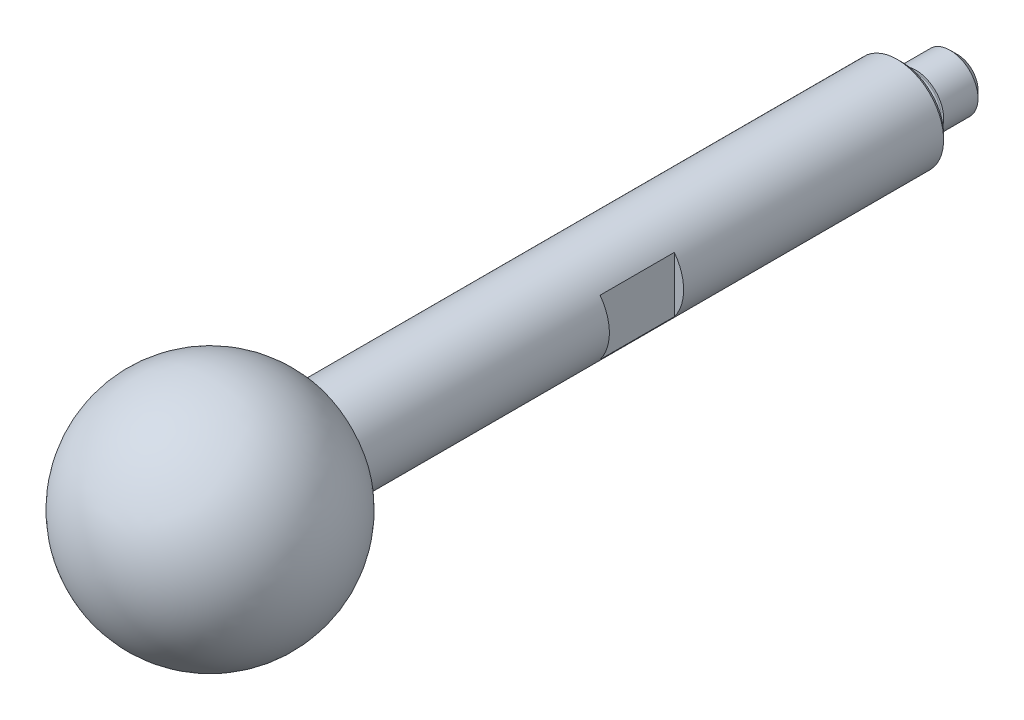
ISO-10303-21;
HEADER;
FILE_DESCRIPTION(('STEP AP214'),'2;1');
FILE_NAME('part.step','',(''),(''),'','','');
FILE_SCHEMA(('AUTOMOTIVE_DESIGN { 1 0 10303 214 1 1 1 1 }'));
ENDSEC;
DATA;
#1=APPLICATION_CONTEXT('core data for automotive mechanical design processes');
#2=APPLICATION_PROTOCOL_DEFINITION('international standard','automotive_design',2000,#1);
#3=PRODUCT_CONTEXT('',#1,'mechanical');
#4=PRODUCT('Part','Part','',(#3));
#5=PRODUCT_RELATED_PRODUCT_CATEGORY('part','',(#4));
#6=PRODUCT_DEFINITION_FORMATION('','',#4);
#7=PRODUCT_DEFINITION_CONTEXT('part definition',#1,'design');
#8=PRODUCT_DEFINITION('design','',#6,#7);
#9=PRODUCT_DEFINITION_SHAPE('','',#8);
#10=(LENGTH_UNIT() NAMED_UNIT(*) SI_UNIT(.MILLI.,.METRE.));
#11=(NAMED_UNIT(*) PLANE_ANGLE_UNIT() SI_UNIT($,.RADIAN.));
#12=(NAMED_UNIT(*) SI_UNIT($,.STERADIAN.) SOLID_ANGLE_UNIT());
#13=UNCERTAINTY_MEASURE_WITH_UNIT(LENGTH_MEASURE(1.E-05),#10,'distance_accuracy_value','');
#14=(GEOMETRIC_REPRESENTATION_CONTEXT(3) GLOBAL_UNCERTAINTY_ASSIGNED_CONTEXT((#13)) GLOBAL_UNIT_ASSIGNED_CONTEXT((#10,
#11,#12)) REPRESENTATION_CONTEXT('',''));
#15=CARTESIAN_POINT('',(0.,0.,0.));
#16=DIRECTION('',(0.,0.,1.));
#17=DIRECTION('',(1.,0.,0.));
#18=AXIS2_PLACEMENT_3D('',#15,#16,#17);
#19=CARTESIAN_POINT('',(0.,0.,0.));
#20=DIRECTION('',(0.,0.,-1.));
#21=DIRECTION('',(0.,-1.,0.));
#22=AXIS2_PLACEMENT_3D('',#19,#20,#21);
#23=PLANE('',#22);
#24=CARTESIAN_POINT('',(0.,0.,0.));
#25=DIRECTION('',(0.,0.,-1.));
#26=DIRECTION('',(-1.,0.,0.));
#27=AXIS2_PLACEMENT_3D('',#24,#25,#26);
#28=CIRCLE('',#27,4.5);
#29=CARTESIAN_POINT('',(-4.5,0.,0.));
#30=VERTEX_POINT('',#29);
#31=EDGE_CURVE('E87',#30,#30,#28,.T.);
#32=ORIENTED_EDGE('',*,*,#31,.T.);
#33=EDGE_LOOP('',(#32));
#34=FACE_BOUND('',#33,.T.);
#35=CARTESIAN_POINT('',(0.,0.,0.));
#36=DIRECTION('',(0.,0.,-1.));
#37=DIRECTION('',(0.,1.,0.));
#38=AXIS2_PLACEMENT_3D('',#35,#36,#37);
#39=CIRCLE('',#38,2.75);
#40=CARTESIAN_POINT('',(0.,2.75,0.));
#41=VERTEX_POINT('',#40);
#42=EDGE_CURVE('E86',#41,#41,#39,.T.);
#43=ORIENTED_EDGE('',*,*,#42,.F.);
#44=EDGE_LOOP('',(#43));
#45=FACE_BOUND('',#44,.T.);
#46=ADVANCED_FACE('F14',(#34,#45),#23,.T.);
#47=CARTESIAN_POINT('',(0.,0.,65.));
#48=DIRECTION('',(0.,0.,1.));
#49=DIRECTION('',(-0.330600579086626,0.943770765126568,0.));
#50=AXIS2_PLACEMENT_3D('',#47,#48,#49);
#51=PLANE('',#50);
#52=CARTESIAN_POINT('',(0.,0.,65.));
#53=DIRECTION('',(0.,0.,-1.));
#54=DIRECTION('',(0.330600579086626,-0.943770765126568,0.));
#55=AXIS2_PLACEMENT_3D('',#52,#53,#54);
#56=CIRCLE('',#55,8.12403840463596);
#57=CARTESIAN_POINT('',(2.68581180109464,-7.6672299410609,65.));
#58=VERTEX_POINT('',#57);
#59=EDGE_CURVE('E65',#58,#58,#56,.T.);
#60=ORIENTED_EDGE('',*,*,#59,.T.);
#61=EDGE_LOOP('',(#60));
#62=FACE_BOUND('',#61,.T.);
#63=CARTESIAN_POINT('',(0.,0.,65.));
#64=DIRECTION('',(0.,0.,-1.));
#65=DIRECTION('',(0.,-1.,0.));
#66=AXIS2_PLACEMENT_3D('',#63,#64,#65);
#67=CIRCLE('',#66,5.);
#68=CARTESIAN_POINT('',(0.,-5.,65.));
#69=VERTEX_POINT('',#68);
#70=EDGE_CURVE('E82',#69,#69,#67,.T.);
#71=ORIENTED_EDGE('',*,*,#70,.F.);
#72=EDGE_LOOP('',(#71));
#73=FACE_BOUND('',#72,.T.);
#74=ADVANCED_FACE('F108',(#62,#73),#51,.F.);
#75=CARTESIAN_POINT('',(0.,0.,74.5));
#76=DIRECTION('',(0.,0.,-1.));
#77=DIRECTION('',(-0.943770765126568,-0.330600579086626,0.));
#78=AXIS2_PLACEMENT_3D('',#75,#76,#77);
#79=SPHERICAL_SURFACE('',#78,12.5);
#80=ORIENTED_EDGE('',*,*,#59,.F.);
#81=EDGE_LOOP('',(#80));
#82=FACE_BOUND('',#81,.T.);
#83=ADVANCED_FACE('F114',(#82),#79,.T.);
#84=CARTESIAN_POINT('',(-4.,4.,28.5));
#85=DIRECTION('',(0.,0.,-1.));
#86=DIRECTION('',(0.,-1.,0.));
#87=AXIS2_PLACEMENT_3D('',#84,#85,#86);
#88=PLANE('',#87);
#89=DIRECTION('',(0.,-1.,0.));
#90=VECTOR('',#89,1.);
#91=CARTESIAN_POINT('',(-4.,4.,28.5));
#92=LINE('',#91,#90);
#93=CARTESIAN_POINT('',(-4.,3.,28.5));
#94=VERTEX_POINT('',#93);
#95=CARTESIAN_POINT('',(-4.,-3.,28.5));
#96=VERTEX_POINT('',#95);
#97=EDGE_CURVE('E69',#94,#96,#92,.T.);
#98=ORIENTED_EDGE('',*,*,#97,.F.);
#99=CARTESIAN_POINT('',(0.,0.,28.5));
#100=DIRECTION('',(0.,0.,-1.));
#101=DIRECTION('',(0.,-1.,0.));
#102=AXIS2_PLACEMENT_3D('',#99,#100,#101);
#103=CIRCLE('',#102,5.);
#104=EDGE_CURVE('E185',#96,#94,#103,.T.);
#105=ORIENTED_EDGE('',*,*,#104,.F.);
#106=EDGE_LOOP('',(#98,#105));
#107=FACE_BOUND('',#106,.T.);
#108=ADVANCED_FACE('F136',(#107),#88,.F.);
#109=CARTESIAN_POINT('',(-4.,4.,36.5));
#110=DIRECTION('',(0.,0.,1.));
#111=DIRECTION('',(0.,1.,0.));
#112=AXIS2_PLACEMENT_3D('',#109,#110,#111);
#113=PLANE('',#112);
#114=DIRECTION('',(0.,1.,0.));
#115=VECTOR('',#114,1.);
#116=CARTESIAN_POINT('',(-4.,4.,36.5));
#117=LINE('',#116,#115);
#118=CARTESIAN_POINT('',(-4.,-3.,36.5));
#119=VERTEX_POINT('',#118);
#120=CARTESIAN_POINT('',(-4.,3.,36.5));
#121=VERTEX_POINT('',#120);
#122=EDGE_CURVE('E183',#119,#121,#117,.T.);
#123=ORIENTED_EDGE('',*,*,#122,.F.);
#124=CARTESIAN_POINT('',(0.,0.,36.5));
#125=DIRECTION('',(0.,0.,1.));
#126=DIRECTION('',(0.,1.,0.));
#127=AXIS2_PLACEMENT_3D('',#124,#125,#126);
#128=CIRCLE('',#127,5.);
#129=EDGE_CURVE('E35',#121,#119,#128,.T.);
#130=ORIENTED_EDGE('',*,*,#129,.F.);
#131=EDGE_LOOP('',(#123,#130));
#132=FACE_BOUND('',#131,.T.);
#133=ADVANCED_FACE('F123',(#132),#113,.F.);
#134=CARTESIAN_POINT('',(-4.,4.,28.5));
#135=DIRECTION('',(-1.,0.,0.));
#136=DIRECTION('',(0.,0.,-1.));
#137=AXIS2_PLACEMENT_3D('',#134,#135,#136);
#138=PLANE('',#137);
#139=DIRECTION('',(0.,0.,1.));
#140=VECTOR('',#139,1.);
#141=CARTESIAN_POINT('',(-4.,-3.,0.));
#142=LINE('',#141,#140);
#143=EDGE_CURVE('E76',#96,#119,#142,.T.);
#144=ORIENTED_EDGE('',*,*,#143,.T.);
#145=ORIENTED_EDGE('',*,*,#122,.T.);
#146=DIRECTION('',(0.,0.,1.));
#147=VECTOR('',#146,1.);
#148=CARTESIAN_POINT('',(-4.,3.,0.));
#149=LINE('',#148,#147);
#150=EDGE_CURVE('E191',#121,#94,#149,.F.);
#151=ORIENTED_EDGE('',*,*,#150,.T.);
#152=ORIENTED_EDGE('',*,*,#97,.T.);
#153=EDGE_LOOP('',(#144,#145,#151,#152));
#154=FACE_BOUND('',#153,.T.);
#155=ADVANCED_FACE('F135',(#154),#138,.T.);
#156=CARTESIAN_POINT('',(4.,-4.,28.5));
#157=DIRECTION('',(0.,0.,-1.));
#158=DIRECTION('',(0.,-1.,0.));
#159=AXIS2_PLACEMENT_3D('',#156,#157,#158);
#160=PLANE('',#159);
#161=DIRECTION('',(0.,1.,0.));
#162=VECTOR('',#161,1.);
#163=CARTESIAN_POINT('',(4.,-4.,28.5));
#164=LINE('',#163,#162);
#165=CARTESIAN_POINT('',(4.,-3.,28.5));
#166=VERTEX_POINT('',#165);
#167=CARTESIAN_POINT('',(4.,3.,28.5));
#168=VERTEX_POINT('',#167);
#169=EDGE_CURVE('E62',#166,#168,#164,.T.);
#170=ORIENTED_EDGE('',*,*,#169,.F.);
#171=CARTESIAN_POINT('',(0.,0.,28.5));
#172=DIRECTION('',(0.,0.,-1.));
#173=DIRECTION('',(0.,-1.,0.));
#174=AXIS2_PLACEMENT_3D('',#171,#172,#173);
#175=CIRCLE('',#174,5.);
#176=EDGE_CURVE('E73',#168,#166,#175,.T.);
#177=ORIENTED_EDGE('',*,*,#176,.F.);
#178=EDGE_LOOP('',(#170,#177));
#179=FACE_BOUND('',#178,.T.);
#180=ADVANCED_FACE('F132',(#179),#160,.F.);
#181=CARTESIAN_POINT('',(4.,-4.,36.5));
#182=DIRECTION('',(0.,0.,1.));
#183=DIRECTION('',(0.,1.,0.));
#184=AXIS2_PLACEMENT_3D('',#181,#182,#183);
#185=PLANE('',#184);
#186=DIRECTION('',(0.,-1.,0.));
#187=VECTOR('',#186,1.);
#188=CARTESIAN_POINT('',(4.,-4.,36.5));
#189=LINE('',#188,#187);
#190=CARTESIAN_POINT('',(4.,3.,36.5));
#191=VERTEX_POINT('',#190);
#192=CARTESIAN_POINT('',(4.,-3.,36.5));
#193=VERTEX_POINT('',#192);
#194=EDGE_CURVE('E59',#191,#193,#189,.T.);
#195=ORIENTED_EDGE('',*,*,#194,.F.);
#196=CARTESIAN_POINT('',(0.,0.,36.5));
#197=DIRECTION('',(0.,0.,1.));
#198=DIRECTION('',(0.,1.,0.));
#199=AXIS2_PLACEMENT_3D('',#196,#197,#198);
#200=CIRCLE('',#199,5.);
#201=EDGE_CURVE('E28',#193,#191,#200,.T.);
#202=ORIENTED_EDGE('',*,*,#201,.F.);
#203=EDGE_LOOP('',(#195,#202));
#204=FACE_BOUND('',#203,.T.);
#205=ADVANCED_FACE('F68',(#204),#185,.F.);
#206=CARTESIAN_POINT('',(4.,-4.,28.5));
#207=DIRECTION('',(1.,0.,0.));
#208=DIRECTION('',(0.,0.,-1.));
#209=AXIS2_PLACEMENT_3D('',#206,#207,#208);
#210=PLANE('',#209);
#211=DIRECTION('',(0.,0.,1.));
#212=VECTOR('',#211,1.);
#213=CARTESIAN_POINT('',(4.,3.,0.));
#214=LINE('',#213,#212);
#215=EDGE_CURVE('E57',#168,#191,#214,.T.);
#216=ORIENTED_EDGE('',*,*,#215,.T.);
#217=ORIENTED_EDGE('',*,*,#194,.T.);
#218=DIRECTION('',(0.,0.,1.));
#219=VECTOR('',#218,1.);
#220=CARTESIAN_POINT('',(4.,-3.,0.));
#221=LINE('',#220,#219);
#222=EDGE_CURVE('E66',#193,#166,#221,.F.);
#223=ORIENTED_EDGE('',*,*,#222,.T.);
#224=ORIENTED_EDGE('',*,*,#169,.T.);
#225=EDGE_LOOP('',(#216,#217,#223,#224));
#226=FACE_BOUND('',#225,.T.);
#227=ADVANCED_FACE('F58',(#226),#210,.T.);
#228=CARTESIAN_POINT('',(0.,0.,0.));
#229=DIRECTION('',(0.,0.,1.));
#230=DIRECTION('',(0.,1.,0.));
#231=AXIS2_PLACEMENT_3D('',#228,#229,#230);
#232=CYLINDRICAL_SURFACE('',#231,5.);
#233=CARTESIAN_POINT('',(0.,0.,0.499999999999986));
#234=DIRECTION('',(0.,0.,-1.));
#235=DIRECTION('',(-1.,0.,0.));
#236=AXIS2_PLACEMENT_3D('',#233,#234,#235);
#237=CIRCLE('',#236,5.);
#238=CARTESIAN_POINT('',(-5.,0.,0.499999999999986));
#239=VERTEX_POINT('',#238);
#240=EDGE_CURVE('E90',#239,#239,#237,.F.);
#241=ORIENTED_EDGE('',*,*,#240,.T.);
#242=EDGE_LOOP('',(#241));
#243=FACE_BOUND('',#242,.T.);
#244=ORIENTED_EDGE('',*,*,#222,.F.);
#245=ORIENTED_EDGE('',*,*,#201,.T.);
#246=ORIENTED_EDGE('',*,*,#215,.F.);
#247=ORIENTED_EDGE('',*,*,#176,.T.);
#248=EDGE_LOOP('',(#244,#245,#246,#247));
#249=FACE_BOUND('',#248,.T.);
#250=ORIENTED_EDGE('',*,*,#150,.F.);
#251=ORIENTED_EDGE('',*,*,#129,.T.);
#252=ORIENTED_EDGE('',*,*,#143,.F.);
#253=ORIENTED_EDGE('',*,*,#104,.T.);
#254=EDGE_LOOP('',(#250,#251,#252,#253));
#255=FACE_BOUND('',#254,.T.);
#256=ORIENTED_EDGE('',*,*,#70,.T.);
#257=EDGE_LOOP('',(#256));
#258=FACE_BOUND('',#257,.T.);
#259=ADVANCED_FACE('F71',(#243,#249,#255,#258),#232,.T.);
#260=CARTESIAN_POINT('',(0.,2.75,-1.5));
#261=DIRECTION('',(0.,0.,-1.));
#262=DIRECTION('',(0.,1.,0.));
#263=AXIS2_PLACEMENT_3D('',#260,#261,#262);
#264=PLANE('',#263);
#265=CARTESIAN_POINT('',(0.,0.,-1.5));
#266=DIRECTION('',(0.,0.,-1.));
#267=DIRECTION('',(0.,1.,0.));
#268=AXIS2_PLACEMENT_3D('',#265,#266,#267);
#269=CIRCLE('',#268,2.75);
#270=CARTESIAN_POINT('',(0.,2.75,-1.5));
#271=VERTEX_POINT('',#270);
#272=EDGE_CURVE('E168',#271,#271,#269,.T.);
#273=ORIENTED_EDGE('',*,*,#272,.T.);
#274=EDGE_LOOP('',(#273));
#275=FACE_BOUND('',#274,.T.);
#276=CARTESIAN_POINT('',(0.,0.,-1.5));
#277=DIRECTION('',(0.,0.,-1.));
#278=DIRECTION('',(0.,1.,0.));
#279=AXIS2_PLACEMENT_3D('',#276,#277,#278);
#280=CIRCLE('',#279,3.);
#281=CARTESIAN_POINT('',(0.,3.,-1.5));
#282=VERTEX_POINT('',#281);
#283=EDGE_CURVE('E83',#282,#282,#280,.T.);
#284=ORIENTED_EDGE('',*,*,#283,.F.);
#285=EDGE_LOOP('',(#284));
#286=FACE_BOUND('',#285,.T.);
#287=ADVANCED_FACE('F121',(#275,#286),#264,.F.);
#288=CARTESIAN_POINT('',(0.,0.,-0.4));
#289=DIRECTION('',(0.,0.,-1.));
#290=DIRECTION('',(0.,1.,0.));
#291=AXIS2_PLACEMENT_3D('',#288,#289,#290);
#292=TOROIDAL_SURFACE('',#291,2.75,0.4);
#293=CARTESIAN_POINT('',(0.,0.,-0.4));
#294=DIRECTION('',(0.,0.,-1.));
#295=DIRECTION('',(0.,1.,0.));
#296=AXIS2_PLACEMENT_3D('',#293,#294,#295);
#297=CIRCLE('',#296,2.35);
#298=CARTESIAN_POINT('',(0.,2.35,-0.4));
#299=VERTEX_POINT('',#298);
#300=EDGE_CURVE('E172',#299,#299,#297,.T.);
#301=ORIENTED_EDGE('',*,*,#300,.F.);
#302=EDGE_LOOP('',(#301));
#303=FACE_BOUND('',#302,.T.);
#304=ORIENTED_EDGE('',*,*,#42,.T.);
#305=EDGE_LOOP('',(#304));
#306=FACE_BOUND('',#305,.T.);
#307=ADVANCED_FACE('F128',(#303,#306),#292,.F.);
#308=CARTESIAN_POINT('',(0.,0.,-6.));
#309=DIRECTION('',(0.,0.,-1.));
#310=DIRECTION('',(0.,1.,0.));
#311=AXIS2_PLACEMENT_3D('',#308,#309,#310);
#312=CYLINDRICAL_SURFACE('',#311,2.35);
#313=CARTESIAN_POINT('',(0.,0.,-1.1));
#314=DIRECTION('',(0.,0.,-1.));
#315=DIRECTION('',(0.,1.,0.));
#316=AXIS2_PLACEMENT_3D('',#313,#314,#315);
#317=CIRCLE('',#316,2.35);
#318=CARTESIAN_POINT('',(0.,2.35,-1.1));
#319=VERTEX_POINT('',#318);
#320=EDGE_CURVE('E171',#319,#319,#317,.T.);
#321=ORIENTED_EDGE('',*,*,#320,.F.);
#322=EDGE_LOOP('',(#321));
#323=FACE_BOUND('',#322,.T.);
#324=ORIENTED_EDGE('',*,*,#300,.T.);
#325=EDGE_LOOP('',(#324));
#326=FACE_BOUND('',#325,.T.);
#327=ADVANCED_FACE('F153',(#323,#326),#312,.T.);
#328=CARTESIAN_POINT('',(0.,0.,-1.1));
#329=DIRECTION('',(0.,0.,-1.));
#330=DIRECTION('',(0.,1.,0.));
#331=AXIS2_PLACEMENT_3D('',#328,#329,#330);
#332=TOROIDAL_SURFACE('',#331,2.75,0.4);
#333=ORIENTED_EDGE('',*,*,#272,.F.);
#334=EDGE_LOOP('',(#333));
#335=FACE_BOUND('',#334,.T.);
#336=ORIENTED_EDGE('',*,*,#320,.T.);
#337=EDGE_LOOP('',(#336));
#338=FACE_BOUND('',#337,.T.);
#339=ADVANCED_FACE('F157',(#335,#338),#332,.F.);
#340=CARTESIAN_POINT('',(0.,0.,-6.));
#341=DIRECTION('',(0.,0.,1.));
#342=DIRECTION('',(0.,1.,0.));
#343=AXIS2_PLACEMENT_3D('',#340,#341,#342);
#344=PLANE('',#343);
#345=CARTESIAN_POINT('',(0.,0.,-6.));
#346=DIRECTION('',(0.,0.,1.));
#347=DIRECTION('',(0.,-1.,0.));
#348=AXIS2_PLACEMENT_3D('',#345,#346,#347);
#349=CIRCLE('',#348,2.2);
#350=CARTESIAN_POINT('',(0.,-2.2,-6.));
#351=VERTEX_POINT('',#350);
#352=EDGE_CURVE('E22',#351,#351,#349,.F.);
#353=ORIENTED_EDGE('',*,*,#352,.T.);
#354=EDGE_LOOP('',(#353));
#355=FACE_BOUND('',#354,.T.);
#356=ADVANCED_FACE('F95',(#355),#344,.F.);
#357=CARTESIAN_POINT('',(0.,0.,14.));
#358=DIRECTION('',(0.,0.,1.));
#359=DIRECTION('',(0.,1.,0.));
#360=AXIS2_PLACEMENT_3D('',#357,#358,#359);
#361=CYLINDRICAL_SURFACE('',#360,3.);
#362=CARTESIAN_POINT('',(0.,0.,-5.2));
#363=DIRECTION('',(0.,0.,1.));
#364=DIRECTION('',(0.,-1.,0.));
#365=AXIS2_PLACEMENT_3D('',#362,#363,#364);
#366=CIRCLE('',#365,3.);
#367=CARTESIAN_POINT('',(0.,-3.,-5.2));
#368=VERTEX_POINT('',#367);
#369=EDGE_CURVE('E9',#368,#368,#366,.T.);
#370=ORIENTED_EDGE('',*,*,#369,.T.);
#371=EDGE_LOOP('',(#370));
#372=FACE_BOUND('',#371,.T.);
#373=ORIENTED_EDGE('',*,*,#283,.T.);
#374=EDGE_LOOP('',(#373));
#375=FACE_BOUND('',#374,.T.);
#376=ADVANCED_FACE('F104',(#372,#375),#361,.T.);
#377=CARTESIAN_POINT('',(0.,0.,0.));
#378=DIRECTION('',(0.,0.,1.));
#379=DIRECTION('',(1.,0.,0.));
#380=AXIS2_PLACEMENT_3D('',#377,#378,#379);
#381=CONICAL_SURFACE('',#380,4.5,0.785398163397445);
#382=ORIENTED_EDGE('',*,*,#240,.F.);
#383=EDGE_LOOP('',(#382));
#384=FACE_BOUND('',#383,.T.);
#385=ORIENTED_EDGE('',*,*,#31,.F.);
#386=EDGE_LOOP('',(#385));
#387=FACE_BOUND('',#386,.T.);
#388=ADVANCED_FACE('F98',(#384,#387),#381,.T.);
#389=CARTESIAN_POINT('',(0.,0.,-6.));
#390=DIRECTION('',(0.,0.,1.));
#391=DIRECTION('',(0.,-1.,0.));
#392=AXIS2_PLACEMENT_3D('',#389,#390,#391);
#393=CONICAL_SURFACE('',#392,2.2,0.785398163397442);
#394=ORIENTED_EDGE('',*,*,#369,.F.);
#395=EDGE_LOOP('',(#394));
#396=FACE_BOUND('',#395,.T.);
#397=ORIENTED_EDGE('',*,*,#352,.F.);
#398=EDGE_LOOP('',(#397));
#399=FACE_BOUND('',#398,.T.);
#400=ADVANCED_FACE('F16',(#396,#399),#393,.T.);
#401=CLOSED_SHELL('',(#46,#74,#83,#108,#133,#155,#180,#205,#227,#259,#287,#307,#327,#339,#356,
#376,#388,#400));
#402=MANIFOLD_SOLID_BREP('B1',#401);
#403=ADVANCED_BREP_SHAPE_REPRESENTATION('',(#18,#402),#14);
#404=SHAPE_DEFINITION_REPRESENTATION(#9,#403);
ENDSEC;
END-ISO-10303-21;
